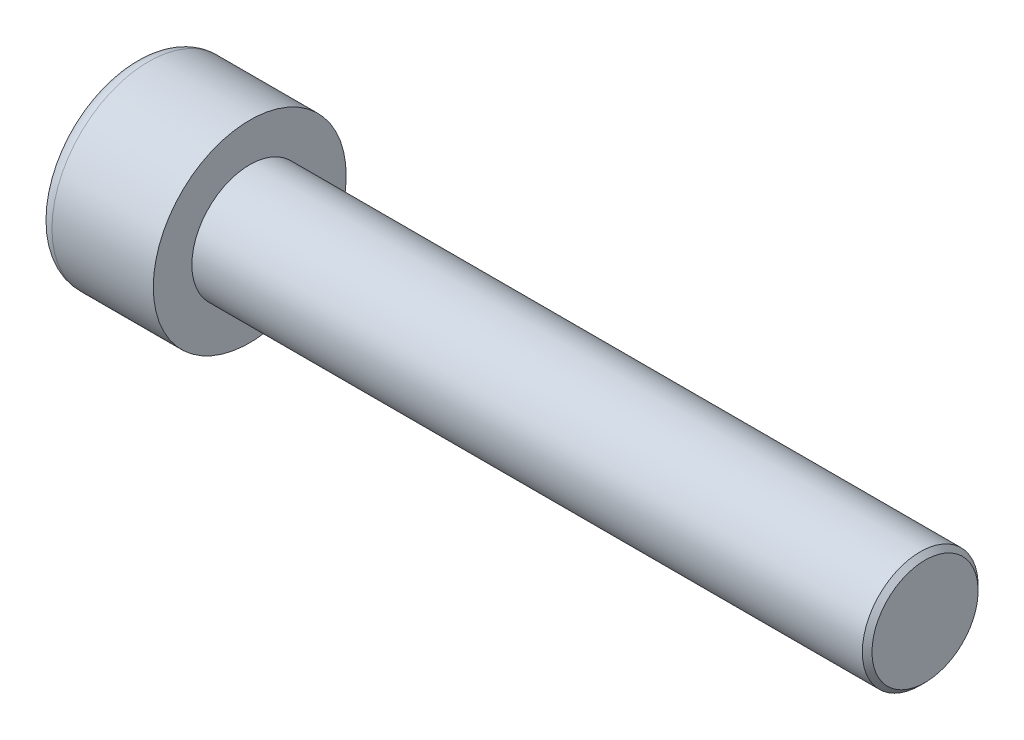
ISO-10303-21;
HEADER;
FILE_DESCRIPTION(('STEP AP214'),'2;1');
FILE_NAME('part.step','',(''),(''),'','','');
FILE_SCHEMA(('AUTOMOTIVE_DESIGN { 1 0 10303 214 1 1 1 1 }'));
ENDSEC;
DATA;
#1=APPLICATION_CONTEXT('core data for automotive mechanical design processes');
#2=APPLICATION_PROTOCOL_DEFINITION('international standard','automotive_design',2000,#1);
#3=PRODUCT_CONTEXT('',#1,'mechanical');
#4=PRODUCT('Part','Part','',(#3));
#5=PRODUCT_RELATED_PRODUCT_CATEGORY('part','',(#4));
#6=PRODUCT_DEFINITION_FORMATION('','',#4);
#7=PRODUCT_DEFINITION_CONTEXT('part definition',#1,'design');
#8=PRODUCT_DEFINITION('design','',#6,#7);
#9=PRODUCT_DEFINITION_SHAPE('','',#8);
#10=(LENGTH_UNIT() NAMED_UNIT(*) SI_UNIT(.MILLI.,.METRE.));
#11=(NAMED_UNIT(*) PLANE_ANGLE_UNIT() SI_UNIT($,.RADIAN.));
#12=(NAMED_UNIT(*) SI_UNIT($,.STERADIAN.) SOLID_ANGLE_UNIT());
#13=UNCERTAINTY_MEASURE_WITH_UNIT(LENGTH_MEASURE(1.E-05),#10,'distance_accuracy_value','');
#14=(GEOMETRIC_REPRESENTATION_CONTEXT(3) GLOBAL_UNCERTAINTY_ASSIGNED_CONTEXT((#13)) GLOBAL_UNIT_ASSIGNED_CONTEXT((#10,
#11,#12)) REPRESENTATION_CONTEXT('',''));
#15=CARTESIAN_POINT('',(0.,0.,0.));
#16=DIRECTION('',(0.,0.,1.));
#17=DIRECTION('',(1.,0.,0.));
#18=AXIS2_PLACEMENT_3D('',#15,#16,#17);
#19=CARTESIAN_POINT('',(3.,0.,-2.88675134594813));
#20=DIRECTION('',(1.,0.,0.));
#21=DIRECTION('',(0.,0.,-1.));
#22=AXIS2_PLACEMENT_3D('',#19,#20,#21);
#23=PLANE('',#22);
#24=DIRECTION('',(0.,0.,-1.));
#25=VECTOR('',#24,1.);
#26=CARTESIAN_POINT('',(3.,2.5,-2.88675134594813));
#27=LINE('',#26,#25);
#28=CARTESIAN_POINT('',(3.,2.5,-1.44337567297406));
#29=VERTEX_POINT('',#28);
#30=CARTESIAN_POINT('',(2.99999999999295,2.50000000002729,0.));
#31=VERTEX_POINT('',#30);
#32=EDGE_CURVE('E81',#29,#31,#27,.F.);
#33=ORIENTED_EDGE('',*,*,#32,.F.);
#34=DIRECTION('',(0.,0.866025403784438,0.5));
#35=VECTOR('',#34,1.);
#36=CARTESIAN_POINT('',(3.,1.25,-2.1650635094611));
#37=LINE('',#36,#35);
#38=CARTESIAN_POINT('',(2.99999999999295,1.25000000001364,-2.16506350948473));
#39=VERTEX_POINT('',#38);
#40=EDGE_CURVE('E104',#39,#29,#37,.T.);
#41=ORIENTED_EDGE('',*,*,#40,.F.);
#42=CARTESIAN_POINT('',(2.9999999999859,0.,0.));
#43=DIRECTION('',(-1.,0.,0.));
#44=DIRECTION('',(0.,0.,1.));
#45=AXIS2_PLACEMENT_3D('',#42,#43,#44);
#46=CIRCLE('',#45,2.50000000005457);
#47=EDGE_CURVE('E112',#39,#31,#46,.F.);
#48=ORIENTED_EDGE('',*,*,#47,.T.);
#49=EDGE_LOOP('',(#33,#41,#48));
#50=FACE_BOUND('',#49,.T.);
#51=ADVANCED_FACE('F17',(#50),#23,.F.);
#52=CARTESIAN_POINT('',(3.,0.,-2.88675134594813));
#53=DIRECTION('',(1.,0.,0.));
#54=DIRECTION('',(0.,0.,-1.));
#55=AXIS2_PLACEMENT_3D('',#52,#53,#54);
#56=PLANE('',#55);
#57=DIRECTION('',(0.,-0.866025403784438,0.500000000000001));
#58=VECTOR('',#57,1.);
#59=CARTESIAN_POINT('',(3.,2.5,1.44337567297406));
#60=LINE('',#59,#58);
#61=CARTESIAN_POINT('',(3.,2.5,1.44337567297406));
#62=VERTEX_POINT('',#61);
#63=CARTESIAN_POINT('',(2.99999999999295,1.25000000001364,2.16506350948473));
#64=VERTEX_POINT('',#63);
#65=EDGE_CURVE('E279',#62,#64,#60,.T.);
#66=ORIENTED_EDGE('',*,*,#65,.F.);
#67=DIRECTION('',(0.,0.,-1.));
#68=VECTOR('',#67,1.);
#69=CARTESIAN_POINT('',(3.,2.5,-2.88675134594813));
#70=LINE('',#69,#68);
#71=EDGE_CURVE('E283',#31,#62,#70,.F.);
#72=ORIENTED_EDGE('',*,*,#71,.F.);
#73=CARTESIAN_POINT('',(2.9999999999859,0.,0.));
#74=DIRECTION('',(-1.,0.,0.));
#75=DIRECTION('',(0.,0.,1.));
#76=AXIS2_PLACEMENT_3D('',#73,#74,#75);
#77=CIRCLE('',#76,2.50000000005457);
#78=EDGE_CURVE('E118',#31,#64,#77,.F.);
#79=ORIENTED_EDGE('',*,*,#78,.T.);
#80=EDGE_LOOP('',(#66,#72,#79));
#81=FACE_BOUND('',#80,.T.);
#82=ADVANCED_FACE('F324',(#81),#56,.F.);
#83=CARTESIAN_POINT('',(3.,0.,-2.88675134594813));
#84=DIRECTION('',(1.,0.,0.));
#85=DIRECTION('',(0.,0.,-1.));
#86=AXIS2_PLACEMENT_3D('',#83,#84,#85);
#87=PLANE('',#86);
#88=DIRECTION('',(0.,0.866025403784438,-0.500000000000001));
#89=VECTOR('',#88,1.);
#90=CARTESIAN_POINT('',(3.,-2.5,-1.44337567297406));
#91=LINE('',#90,#89);
#92=CARTESIAN_POINT('',(3.,-2.5,-1.44337567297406));
#93=VERTEX_POINT('',#92);
#94=CARTESIAN_POINT('',(2.99999999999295,-1.25000000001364,-2.16506350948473));
#95=VERTEX_POINT('',#94);
#96=EDGE_CURVE('E119',#93,#95,#91,.T.);
#97=ORIENTED_EDGE('',*,*,#96,.F.);
#98=DIRECTION('',(0.,0.,-1.));
#99=VECTOR('',#98,1.);
#100=CARTESIAN_POINT('',(3.,-2.5,-2.88675134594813));
#101=LINE('',#100,#99);
#102=CARTESIAN_POINT('',(2.99999999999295,-2.50000000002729,0.));
#103=VERTEX_POINT('',#102);
#104=EDGE_CURVE('E123',#103,#93,#101,.T.);
#105=ORIENTED_EDGE('',*,*,#104,.F.);
#106=CARTESIAN_POINT('',(2.9999999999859,0.,0.));
#107=DIRECTION('',(-1.,0.,0.));
#108=DIRECTION('',(0.,0.,1.));
#109=AXIS2_PLACEMENT_3D('',#106,#107,#108);
#110=CIRCLE('',#109,2.50000000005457);
#111=EDGE_CURVE('E98',#103,#95,#110,.F.);
#112=ORIENTED_EDGE('',*,*,#111,.T.);
#113=EDGE_LOOP('',(#97,#105,#112));
#114=FACE_BOUND('',#113,.T.);
#115=ADVANCED_FACE('F336',(#114),#87,.F.);
#116=CARTESIAN_POINT('',(2.9999999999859,0.,0.));
#117=DIRECTION('',(-1.,0.,0.));
#118=DIRECTION('',(0.,0.,1.));
#119=AXIS2_PLACEMENT_3D('',#116,#117,#118);
#120=CONICAL_SURFACE('',#119,2.50000000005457,1.04719755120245);
#121=CARTESIAN_POINT('',(4.44337567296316,0.,0.));
#122=VERTEX_POINT('',#121);
#123=VERTEX_LOOP('',#122);
#124=FACE_BOUND('',#123,.T.);
#125=ORIENTED_EDGE('',*,*,#47,.F.);
#126=CARTESIAN_POINT('',(2.9999999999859,0.,0.));
#127=DIRECTION('',(-1.,0.,0.));
#128=DIRECTION('',(0.,0.,1.));
#129=AXIS2_PLACEMENT_3D('',#126,#127,#128);
#130=CIRCLE('',#129,2.50000000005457);
#131=EDGE_CURVE('E87',#95,#39,#130,.F.);
#132=ORIENTED_EDGE('',*,*,#131,.F.);
#133=ORIENTED_EDGE('',*,*,#111,.F.);
#134=CARTESIAN_POINT('',(2.9999999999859,0.,0.));
#135=DIRECTION('',(-1.,0.,0.));
#136=DIRECTION('',(0.,0.,1.));
#137=AXIS2_PLACEMENT_3D('',#134,#135,#136);
#138=CIRCLE('',#137,2.50000000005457);
#139=CARTESIAN_POINT('',(2.99999999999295,-1.25000000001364,2.16506350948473));
#140=VERTEX_POINT('',#139);
#141=EDGE_CURVE('E97',#103,#140,#138,.T.);
#142=ORIENTED_EDGE('',*,*,#141,.T.);
#143=CARTESIAN_POINT('',(2.9999999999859,0.,0.));
#144=DIRECTION('',(-1.,0.,0.));
#145=DIRECTION('',(0.,0.,1.));
#146=AXIS2_PLACEMENT_3D('',#143,#144,#145);
#147=CIRCLE('',#146,2.50000000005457);
#148=EDGE_CURVE('E121',#64,#140,#147,.F.);
#149=ORIENTED_EDGE('',*,*,#148,.F.);
#150=ORIENTED_EDGE('',*,*,#78,.F.);
#151=EDGE_LOOP('',(#125,#132,#133,#142,#149,#150));
#152=FACE_BOUND('',#151,.T.);
#153=ADVANCED_FACE('F116',(#124,#152),#120,.F.);
#154=CARTESIAN_POINT('',(3.,0.,-2.88675134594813));
#155=DIRECTION('',(1.,0.,0.));
#156=DIRECTION('',(0.,0.,-1.));
#157=AXIS2_PLACEMENT_3D('',#154,#155,#156);
#158=PLANE('',#157);
#159=DIRECTION('',(0.,0.,1.));
#160=VECTOR('',#159,1.);
#161=CARTESIAN_POINT('',(3.,-2.5,1.44337567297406));
#162=LINE('',#161,#160);
#163=CARTESIAN_POINT('',(3.,-2.5,1.44337567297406));
#164=VERTEX_POINT('',#163);
#165=EDGE_CURVE('E234',#164,#103,#162,.F.);
#166=ORIENTED_EDGE('',*,*,#165,.F.);
#167=DIRECTION('',(0.,0.866025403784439,0.5));
#168=VECTOR('',#167,1.);
#169=CARTESIAN_POINT('',(3.,0.,2.88675134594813));
#170=LINE('',#169,#168);
#171=EDGE_CURVE('E251',#140,#164,#170,.F.);
#172=ORIENTED_EDGE('',*,*,#171,.F.);
#173=ORIENTED_EDGE('',*,*,#141,.F.);
#174=EDGE_LOOP('',(#166,#172,#173));
#175=FACE_BOUND('',#174,.T.);
#176=ADVANCED_FACE('F252',(#175),#158,.F.);
#177=CARTESIAN_POINT('',(3.,0.,-2.88675134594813));
#178=DIRECTION('',(1.,0.,0.));
#179=DIRECTION('',(0.,0.,-1.));
#180=AXIS2_PLACEMENT_3D('',#177,#178,#179);
#181=PLANE('',#180);
#182=DIRECTION('',(0.,0.866025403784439,0.5));
#183=VECTOR('',#182,1.);
#184=CARTESIAN_POINT('',(3.,0.,2.88675134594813));
#185=LINE('',#184,#183);
#186=CARTESIAN_POINT('',(3.,0.,2.88675134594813));
#187=VERTEX_POINT('',#186);
#188=EDGE_CURVE('E241',#187,#140,#185,.F.);
#189=ORIENTED_EDGE('',*,*,#188,.F.);
#190=DIRECTION('',(0.,0.866025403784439,-0.5));
#191=VECTOR('',#190,1.);
#192=CARTESIAN_POINT('',(3.,2.5,1.44337567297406));
#193=LINE('',#192,#191);
#194=EDGE_CURVE('E244',#64,#187,#193,.F.);
#195=ORIENTED_EDGE('',*,*,#194,.F.);
#196=ORIENTED_EDGE('',*,*,#148,.T.);
#197=EDGE_LOOP('',(#189,#195,#196));
#198=FACE_BOUND('',#197,.T.);
#199=ADVANCED_FACE('F239',(#198),#181,.F.);
#200=CARTESIAN_POINT('',(3.,0.,-2.88675134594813));
#201=DIRECTION('',(1.,0.,0.));
#202=DIRECTION('',(0.,0.,-1.));
#203=AXIS2_PLACEMENT_3D('',#200,#201,#202);
#204=PLANE('',#203);
#205=DIRECTION('',(0.,-0.866025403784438,-0.5));
#206=VECTOR('',#205,1.);
#207=CARTESIAN_POINT('',(3.,0.,-2.88675134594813));
#208=LINE('',#207,#206);
#209=CARTESIAN_POINT('',(3.,0.,-2.88675134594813));
#210=VERTEX_POINT('',#209);
#211=EDGE_CURVE('E90',#210,#39,#208,.F.);
#212=ORIENTED_EDGE('',*,*,#211,.F.);
#213=DIRECTION('',(0.,-0.866025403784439,0.5));
#214=VECTOR('',#213,1.);
#215=CARTESIAN_POINT('',(3.,-2.5,-1.44337567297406));
#216=LINE('',#215,#214);
#217=EDGE_CURVE('E93',#95,#210,#216,.F.);
#218=ORIENTED_EDGE('',*,*,#217,.F.);
#219=ORIENTED_EDGE('',*,*,#131,.T.);
#220=EDGE_LOOP('',(#212,#218,#219));
#221=FACE_BOUND('',#220,.T.);
#222=ADVANCED_FACE('F89',(#221),#204,.F.);
#223=CARTESIAN_POINT('',(3.,-2.5,1.44337567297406));
#224=DIRECTION('',(0.,1.,0.));
#225=DIRECTION('',(0.,0.,1.));
#226=AXIS2_PLACEMENT_3D('',#223,#224,#225);
#227=PLANE('',#226);
#228=ORIENTED_EDGE('',*,*,#104,.T.);
#229=DIRECTION('',(1.,0.,0.));
#230=VECTOR('',#229,1.);
#231=CARTESIAN_POINT('',(3.,-2.5,-1.44337567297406));
#232=LINE('',#231,#230);
#233=CARTESIAN_POINT('',(0.,-2.5,-1.44337567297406));
#234=VERTEX_POINT('',#233);
#235=EDGE_CURVE('E294',#234,#93,#232,.T.);
#236=ORIENTED_EDGE('',*,*,#235,.F.);
#237=DIRECTION('',(0.,0.,-1.));
#238=VECTOR('',#237,1.);
#239=CARTESIAN_POINT('',(0.,-2.5,0.));
#240=LINE('',#239,#238);
#241=CARTESIAN_POINT('',(0.,-2.5,1.44337567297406));
#242=VERTEX_POINT('',#241);
#243=EDGE_CURVE('E154',#234,#242,#240,.F.);
#244=ORIENTED_EDGE('',*,*,#243,.T.);
#245=DIRECTION('',(1.,0.,0.));
#246=VECTOR('',#245,1.);
#247=CARTESIAN_POINT('',(3.,-2.5,1.44337567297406));
#248=LINE('',#247,#246);
#249=EDGE_CURVE('E256',#164,#242,#248,.F.);
#250=ORIENTED_EDGE('',*,*,#249,.F.);
#251=ORIENTED_EDGE('',*,*,#165,.T.);
#252=EDGE_LOOP('',(#228,#236,#244,#250,#251));
#253=FACE_BOUND('',#252,.T.);
#254=ADVANCED_FACE('F317',(#253),#227,.T.);
#255=CARTESIAN_POINT('',(3.,0.,2.88675134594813));
#256=DIRECTION('',(0.,0.5,-0.866025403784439));
#257=DIRECTION('',(0.,0.866025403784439,0.5));
#258=AXIS2_PLACEMENT_3D('',#255,#256,#257);
#259=PLANE('',#258);
#260=ORIENTED_EDGE('',*,*,#171,.T.);
#261=ORIENTED_EDGE('',*,*,#249,.T.);
#262=DIRECTION('',(0.,0.866025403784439,0.5));
#263=VECTOR('',#262,1.);
#264=CARTESIAN_POINT('',(0.,-2.5,1.44337567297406));
#265=LINE('',#264,#263);
#266=CARTESIAN_POINT('',(0.,0.,2.88675134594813));
#267=VERTEX_POINT('',#266);
#268=EDGE_CURVE('E151',#242,#267,#265,.T.);
#269=ORIENTED_EDGE('',*,*,#268,.T.);
#270=DIRECTION('',(1.,0.,0.));
#271=VECTOR('',#270,1.);
#272=CARTESIAN_POINT('',(3.,0.,2.88675134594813));
#273=LINE('',#272,#271);
#274=EDGE_CURVE('E260',#187,#267,#273,.F.);
#275=ORIENTED_EDGE('',*,*,#274,.F.);
#276=ORIENTED_EDGE('',*,*,#188,.T.);
#277=EDGE_LOOP('',(#260,#261,#269,#275,#276));
#278=FACE_BOUND('',#277,.T.);
#279=ADVANCED_FACE('F258',(#278),#259,.T.);
#280=CARTESIAN_POINT('',(3.,2.5,1.44337567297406));
#281=DIRECTION('',(0.,-0.5,-0.866025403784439));
#282=DIRECTION('',(0.,0.866025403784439,-0.5));
#283=AXIS2_PLACEMENT_3D('',#280,#281,#282);
#284=PLANE('',#283);
#285=ORIENTED_EDGE('',*,*,#194,.T.);
#286=ORIENTED_EDGE('',*,*,#274,.T.);
#287=DIRECTION('',(0.,0.866025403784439,-0.5));
#288=VECTOR('',#287,1.);
#289=CARTESIAN_POINT('',(0.,0.,2.88675134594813));
#290=LINE('',#289,#288);
#291=CARTESIAN_POINT('',(0.,2.5,1.44337567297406));
#292=VERTEX_POINT('',#291);
#293=EDGE_CURVE('E148',#267,#292,#290,.T.);
#294=ORIENTED_EDGE('',*,*,#293,.T.);
#295=DIRECTION('',(1.,0.,0.));
#296=VECTOR('',#295,1.);
#297=CARTESIAN_POINT('',(3.,2.5,1.44337567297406));
#298=LINE('',#297,#296);
#299=EDGE_CURVE('E109',#62,#292,#298,.F.);
#300=ORIENTED_EDGE('',*,*,#299,.F.);
#301=ORIENTED_EDGE('',*,*,#65,.T.);
#302=EDGE_LOOP('',(#285,#286,#294,#300,#301));
#303=FACE_BOUND('',#302,.T.);
#304=ADVANCED_FACE('F320',(#303),#284,.T.);
#305=CARTESIAN_POINT('',(3.,2.5,-1.44337567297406));
#306=DIRECTION('',(0.,-1.,0.));
#307=DIRECTION('',(0.,0.,-1.));
#308=AXIS2_PLACEMENT_3D('',#305,#306,#307);
#309=PLANE('',#308);
#310=ORIENTED_EDGE('',*,*,#71,.T.);
#311=ORIENTED_EDGE('',*,*,#299,.T.);
#312=DIRECTION('',(0.,0.,-1.));
#313=VECTOR('',#312,1.);
#314=CARTESIAN_POINT('',(0.,2.5,0.));
#315=LINE('',#314,#313);
#316=CARTESIAN_POINT('',(0.,2.5,-1.44337567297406));
#317=VERTEX_POINT('',#316);
#318=EDGE_CURVE('E139',#292,#317,#315,.T.);
#319=ORIENTED_EDGE('',*,*,#318,.T.);
#320=DIRECTION('',(1.,0.,0.));
#321=VECTOR('',#320,1.);
#322=CARTESIAN_POINT('',(3.,2.5,-1.44337567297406));
#323=LINE('',#322,#321);
#324=EDGE_CURVE('E108',#29,#317,#323,.F.);
#325=ORIENTED_EDGE('',*,*,#324,.F.);
#326=ORIENTED_EDGE('',*,*,#32,.T.);
#327=EDGE_LOOP('',(#310,#311,#319,#325,#326));
#328=FACE_BOUND('',#327,.T.);
#329=ADVANCED_FACE('F322',(#328),#309,.T.);
#330=CARTESIAN_POINT('',(3.,0.,-2.88675134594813));
#331=DIRECTION('',(0.,-0.5,0.866025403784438));
#332=DIRECTION('',(0.,-0.866025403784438,-0.5));
#333=AXIS2_PLACEMENT_3D('',#330,#331,#332);
#334=PLANE('',#333);
#335=ORIENTED_EDGE('',*,*,#40,.T.);
#336=ORIENTED_EDGE('',*,*,#324,.T.);
#337=DIRECTION('',(0.,-0.866025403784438,-0.5));
#338=VECTOR('',#337,1.);
#339=CARTESIAN_POINT('',(0.,2.5,-1.44337567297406));
#340=LINE('',#339,#338);
#341=CARTESIAN_POINT('',(0.,0.,-2.88675134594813));
#342=VERTEX_POINT('',#341);
#343=EDGE_CURVE('E133',#317,#342,#340,.T.);
#344=ORIENTED_EDGE('',*,*,#343,.T.);
#345=DIRECTION('',(1.,0.,0.));
#346=VECTOR('',#345,1.);
#347=CARTESIAN_POINT('',(3.,0.,-2.88675134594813));
#348=LINE('',#347,#346);
#349=EDGE_CURVE('E107',#210,#342,#348,.F.);
#350=ORIENTED_EDGE('',*,*,#349,.F.);
#351=ORIENTED_EDGE('',*,*,#211,.T.);
#352=EDGE_LOOP('',(#335,#336,#344,#350,#351));
#353=FACE_BOUND('',#352,.T.);
#354=ADVANCED_FACE('F102',(#353),#334,.T.);
#355=CARTESIAN_POINT('',(3.,-2.5,-1.44337567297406));
#356=DIRECTION('',(0.,0.5,0.866025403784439));
#357=DIRECTION('',(0.,-0.866025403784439,0.5));
#358=AXIS2_PLACEMENT_3D('',#355,#356,#357);
#359=PLANE('',#358);
#360=ORIENTED_EDGE('',*,*,#217,.T.);
#361=ORIENTED_EDGE('',*,*,#349,.T.);
#362=DIRECTION('',(0.,-0.866025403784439,0.5));
#363=VECTOR('',#362,1.);
#364=CARTESIAN_POINT('',(0.,0.,-2.88675134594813));
#365=LINE('',#364,#363);
#366=EDGE_CURVE('E130',#342,#234,#365,.T.);
#367=ORIENTED_EDGE('',*,*,#366,.T.);
#368=ORIENTED_EDGE('',*,*,#235,.T.);
#369=ORIENTED_EDGE('',*,*,#96,.T.);
#370=EDGE_LOOP('',(#360,#361,#367,#368,#369));
#371=FACE_BOUND('',#370,.T.);
#372=ADVANCED_FACE('F190',(#371),#359,.T.);
#373=CARTESIAN_POINT('',(0.,0.,0.));
#374=DIRECTION('',(1.,0.,0.));
#375=DIRECTION('',(0.,0.,-1.));
#376=AXIS2_PLACEMENT_3D('',#373,#374,#375);
#377=PLANE('',#376);
#378=ORIENTED_EDGE('',*,*,#343,.F.);
#379=ORIENTED_EDGE('',*,*,#318,.F.);
#380=ORIENTED_EDGE('',*,*,#293,.F.);
#381=ORIENTED_EDGE('',*,*,#268,.F.);
#382=ORIENTED_EDGE('',*,*,#243,.F.);
#383=ORIENTED_EDGE('',*,*,#366,.F.);
#384=EDGE_LOOP('',(#378,#379,#380,#381,#382,#383));
#385=FACE_BOUND('',#384,.T.);
#386=CARTESIAN_POINT('',(0.,0.,0.));
#387=DIRECTION('',(1.,0.,0.));
#388=DIRECTION('',(0.,0.,-1.));
#389=AXIS2_PLACEMENT_3D('',#386,#387,#388);
#390=CIRCLE('',#389,4.25);
#391=CARTESIAN_POINT('',(0.,0.,-4.25));
#392=VERTEX_POINT('',#391);
#393=CARTESIAN_POINT('',(0.,0.,4.25));
#394=VERTEX_POINT('',#393);
#395=EDGE_CURVE('E128',#392,#394,#390,.T.);
#396=ORIENTED_EDGE('',*,*,#395,.F.);
#397=CARTESIAN_POINT('',(0.,0.,0.));
#398=DIRECTION('',(1.,0.,0.));
#399=DIRECTION('',(0.,0.,1.));
#400=AXIS2_PLACEMENT_3D('',#397,#398,#399);
#401=CIRCLE('',#400,4.25);
#402=EDGE_CURVE('E36',#394,#392,#401,.T.);
#403=ORIENTED_EDGE('',*,*,#402,.F.);
#404=EDGE_LOOP('',(#396,#403));
#405=FACE_BOUND('',#404,.T.);
#406=ADVANCED_FACE('F171',(#385,#405),#377,.F.);
#407=CARTESIAN_POINT('',(0.75,0.,0.));
#408=DIRECTION('',(1.,0.,0.));
#409=DIRECTION('',(0.,0.,-1.));
#410=AXIS2_PLACEMENT_3D('',#407,#408,#409);
#411=TOROIDAL_SURFACE('',#410,4.25,0.75);
#412=CARTESIAN_POINT('',(0.75,0.,0.));
#413=DIRECTION('',(-1.,0.,0.));
#414=DIRECTION('',(0.,0.,1.));
#415=AXIS2_PLACEMENT_3D('',#412,#413,#414);
#416=CIRCLE('',#415,5.);
#417=CARTESIAN_POINT('',(0.75,0.,5.));
#418=VERTEX_POINT('',#417);
#419=EDGE_CURVE('E131',#418,#418,#416,.F.);
#420=ORIENTED_EDGE('',*,*,#419,.F.);
#421=EDGE_LOOP('',(#420));
#422=FACE_BOUND('',#421,.T.);
#423=ORIENTED_EDGE('',*,*,#395,.T.);
#424=ORIENTED_EDGE('',*,*,#402,.T.);
#425=EDGE_LOOP('',(#423,#424));
#426=FACE_BOUND('',#425,.T.);
#427=ADVANCED_FACE('F127',(#422,#426),#411,.T.);
#428=CARTESIAN_POINT('',(41.,0.,0.));
#429=DIRECTION('',(1.,0.,0.));
#430=DIRECTION('',(0.,0.,-1.));
#431=AXIS2_PLACEMENT_3D('',#428,#429,#430);
#432=PLANE('',#431);
#433=CARTESIAN_POINT('',(40.9999999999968,0.,0.));
#434=DIRECTION('',(-1.,0.,0.));
#435=DIRECTION('',(0.,0.,1.));
#436=AXIS2_PLACEMENT_3D('',#433,#434,#435);
#437=CIRCLE('',#436,2.74999999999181);
#438=CARTESIAN_POINT('',(40.9999999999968,0.,2.74999999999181));
#439=VERTEX_POINT('',#438);
#440=EDGE_CURVE('E226',#439,#439,#437,.T.);
#441=ORIENTED_EDGE('',*,*,#440,.F.);
#442=EDGE_LOOP('',(#441));
#443=FACE_BOUND('',#442,.T.);
#444=ADVANCED_FACE('F170',(#443),#432,.T.);
#445=CARTESIAN_POINT('',(6.,0.,0.));
#446=DIRECTION('',(-1.,0.,0.));
#447=DIRECTION('',(0.,0.,1.));
#448=AXIS2_PLACEMENT_3D('',#445,#446,#447);
#449=CYLINDRICAL_SURFACE('',#448,5.);
#450=ORIENTED_EDGE('',*,*,#419,.T.);
#451=EDGE_LOOP('',(#450));
#452=FACE_BOUND('',#451,.T.);
#453=CARTESIAN_POINT('',(6.,0.,0.));
#454=DIRECTION('',(-1.,0.,0.));
#455=DIRECTION('',(0.,0.,1.));
#456=AXIS2_PLACEMENT_3D('',#453,#454,#455);
#457=CIRCLE('',#456,5.);
#458=CARTESIAN_POINT('',(6.,0.,5.));
#459=VERTEX_POINT('',#458);
#460=EDGE_CURVE('E224',#459,#459,#457,.F.);
#461=ORIENTED_EDGE('',*,*,#460,.F.);
#462=EDGE_LOOP('',(#461));
#463=FACE_BOUND('',#462,.T.);
#464=ADVANCED_FACE('F211',(#452,#463),#449,.T.);
#465=CARTESIAN_POINT('',(40.7500000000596,0.,0.));
#466=DIRECTION('',(-1.,0.,0.));
#467=DIRECTION('',(0.,0.,1.));
#468=AXIS2_PLACEMENT_3D('',#465,#466,#467);
#469=CONICAL_SURFACE('',#468,2.99999999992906,0.785398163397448);
#470=CARTESIAN_POINT('',(40.75,0.,0.));
#471=DIRECTION('',(-1.,0.,0.));
#472=DIRECTION('',(0.,0.,1.));
#473=AXIS2_PLACEMENT_3D('',#470,#471,#472);
#474=CIRCLE('',#473,3.);
#475=CARTESIAN_POINT('',(40.75,0.,3.));
#476=VERTEX_POINT('',#475);
#477=EDGE_CURVE('E28',#476,#476,#474,.T.);
#478=ORIENTED_EDGE('',*,*,#477,.F.);
#479=EDGE_LOOP('',(#478));
#480=FACE_BOUND('',#479,.T.);
#481=ORIENTED_EDGE('',*,*,#440,.T.);
#482=EDGE_LOOP('',(#481));
#483=FACE_BOUND('',#482,.T.);
#484=ADVANCED_FACE('F205',(#480,#483),#469,.T.);
#485=CARTESIAN_POINT('',(6.,0.,0.));
#486=DIRECTION('',(1.,0.,0.));
#487=DIRECTION('',(0.,0.,-1.));
#488=AXIS2_PLACEMENT_3D('',#485,#486,#487);
#489=PLANE('',#488);
#490=CARTESIAN_POINT('',(6.,0.,0.));
#491=DIRECTION('',(-1.,0.,0.));
#492=DIRECTION('',(0.,0.,1.));
#493=AXIS2_PLACEMENT_3D('',#490,#491,#492);
#494=CIRCLE('',#493,3.);
#495=CARTESIAN_POINT('',(6.,0.,3.));
#496=VERTEX_POINT('',#495);
#497=EDGE_CURVE('E11',#496,#496,#494,.F.);
#498=ORIENTED_EDGE('',*,*,#497,.F.);
#499=EDGE_LOOP('',(#498));
#500=FACE_BOUND('',#499,.T.);
#501=ORIENTED_EDGE('',*,*,#460,.T.);
#502=EDGE_LOOP('',(#501));
#503=FACE_BOUND('',#502,.T.);
#504=ADVANCED_FACE('F199',(#500,#503),#489,.T.);
#505=CARTESIAN_POINT('',(41.,0.,0.));
#506=DIRECTION('',(-1.,0.,0.));
#507=DIRECTION('',(0.,0.,1.));
#508=AXIS2_PLACEMENT_3D('',#505,#506,#507);
#509=CYLINDRICAL_SURFACE('',#508,3.);
#510=ORIENTED_EDGE('',*,*,#497,.T.);
#511=EDGE_LOOP('',(#510));
#512=FACE_BOUND('',#511,.T.);
#513=ORIENTED_EDGE('',*,*,#477,.T.);
#514=EDGE_LOOP('',(#513));
#515=FACE_BOUND('',#514,.T.);
#516=ADVANCED_FACE('F197',(#512,#515),#509,.T.);
#517=CLOSED_SHELL('',(#51,#82,#115,#153,#176,#199,#222,#254,#279,#304,#329,#354,#372,#406,#427,
#444,#464,#484,#504,#516));
#518=MANIFOLD_SOLID_BREP('B1',#517);
#519=ADVANCED_BREP_SHAPE_REPRESENTATION('',(#18,#518),#14);
#520=SHAPE_DEFINITION_REPRESENTATION(#9,#519);
ENDSEC;
END-ISO-10303-21;
